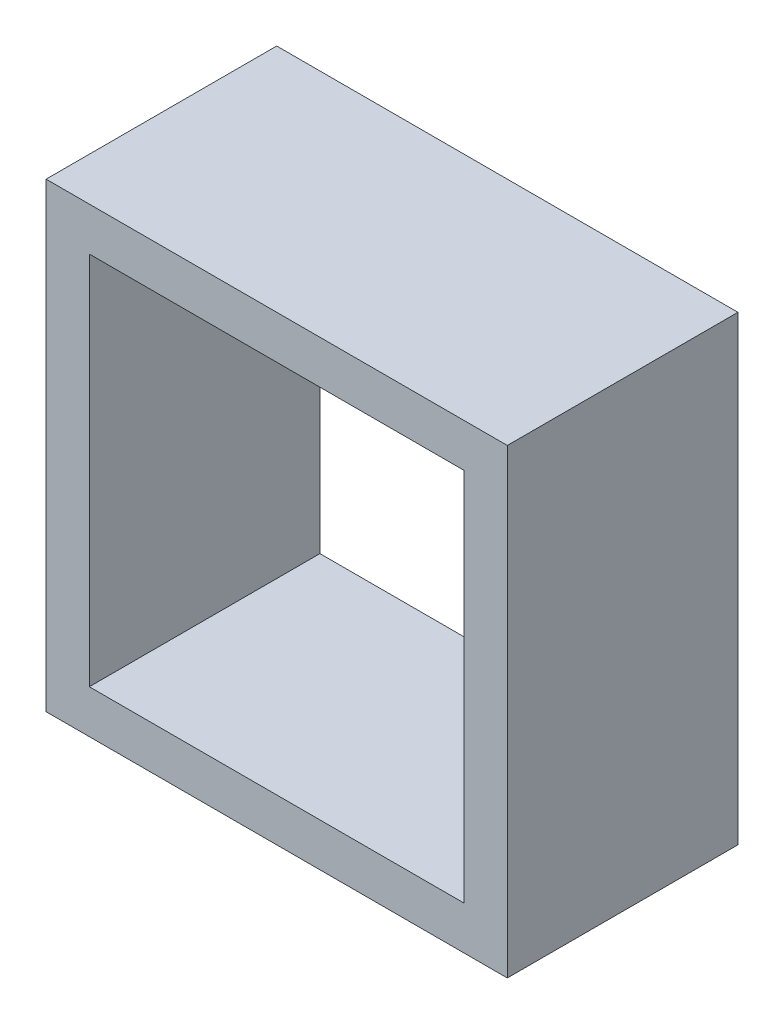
from build123d import *

# Parameters (mm, degrees)
SKETCH1_W      = 50.799956
SKETCH1_H      = 50.799956
SKETCH1_W_2    = 41.274956
SKETCH1_H_2    = 41.274956
BASETUBE_DEPTH = 12.7


with BuildPart() as part:
    # Sketch1 → BaseTube (new, symmetric)
    with BuildSketch(Plane.XY):
        with Locations((25.399978, 25.399978)):
            Rectangle(SKETCH1_W, SKETCH1_H)
        with Locations((25.399978, 25.399978)):
            Rectangle(SKETCH1_W_2, SKETCH1_H_2, mode=Mode.SUBTRACT)
    extrude(amount=BASETUBE_DEPTH, both=True)


solid = part.part
